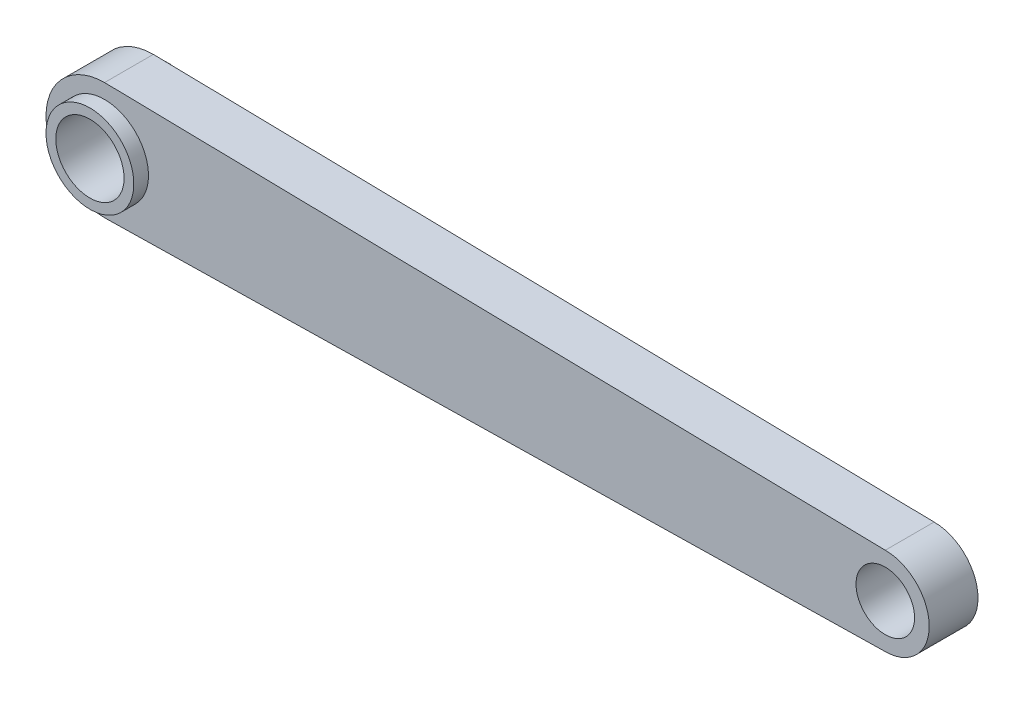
ISO-10303-21;
HEADER;
FILE_DESCRIPTION(('STEP AP214'),'2;1');
FILE_NAME('part.step','',(''),(''),'','','');
FILE_SCHEMA(('AUTOMOTIVE_DESIGN { 1 0 10303 214 1 1 1 1 }'));
ENDSEC;
DATA;
#1=APPLICATION_CONTEXT('core data for automotive mechanical design processes');
#2=APPLICATION_PROTOCOL_DEFINITION('international standard','automotive_design',2000,#1);
#3=PRODUCT_CONTEXT('',#1,'mechanical');
#4=PRODUCT('Part','Part','',(#3));
#5=PRODUCT_RELATED_PRODUCT_CATEGORY('part','',(#4));
#6=PRODUCT_DEFINITION_FORMATION('','',#4);
#7=PRODUCT_DEFINITION_CONTEXT('part definition',#1,'design');
#8=PRODUCT_DEFINITION('design','',#6,#7);
#9=PRODUCT_DEFINITION_SHAPE('','',#8);
#10=(LENGTH_UNIT() NAMED_UNIT(*) SI_UNIT(.MILLI.,.METRE.));
#11=(NAMED_UNIT(*) PLANE_ANGLE_UNIT() SI_UNIT($,.RADIAN.));
#12=(NAMED_UNIT(*) SI_UNIT($,.STERADIAN.) SOLID_ANGLE_UNIT());
#13=UNCERTAINTY_MEASURE_WITH_UNIT(LENGTH_MEASURE(1.E-05),#10,'distance_accuracy_value','');
#14=(GEOMETRIC_REPRESENTATION_CONTEXT(3) GLOBAL_UNCERTAINTY_ASSIGNED_CONTEXT((#13)) GLOBAL_UNIT_ASSIGNED_CONTEXT((#10,
#11,#12)) REPRESENTATION_CONTEXT('',''));
#15=CARTESIAN_POINT('',(0.,0.,0.));
#16=DIRECTION('',(0.,0.,1.));
#17=DIRECTION('',(1.,0.,0.));
#18=AXIS2_PLACEMENT_3D('',#15,#16,#17);
#19=CARTESIAN_POINT('',(0.,0.,6.35000000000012));
#20=DIRECTION('',(0.,0.,0.999999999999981));
#21=DIRECTION('',(1.,0.,0.));
#22=AXIS2_PLACEMENT_3D('',#19,#20,#21);
#23=PLANE('',#22);
#24=CARTESIAN_POINT('',(203.2,0.,6.34999999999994));
#25=DIRECTION('',(0.,0.,0.999999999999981));
#26=DIRECTION('',(1.,0.,0.));
#27=AXIS2_PLACEMENT_3D('',#24,#25,#26);
#28=CIRCLE('',#27,7.62000000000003);
#29=CARTESIAN_POINT('',(210.82,0.,6.34999999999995));
#30=VERTEX_POINT('',#29);
#31=EDGE_CURVE('E147',#30,#30,#28,.T.);
#32=ORIENTED_EDGE('',*,*,#31,.F.);
#33=EDGE_LOOP('',(#32));
#34=FACE_BOUND('',#33,.T.);
#35=CARTESIAN_POINT('',(0.,0.,6.35000000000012));
#36=DIRECTION('',(0.,0.,0.999999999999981));
#37=DIRECTION('',(1.,0.,0.));
#38=AXIS2_PLACEMENT_3D('',#35,#36,#37);
#39=CIRCLE('',#38,15.24);
#40=CARTESIAN_POINT('',(0.,15.2399999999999,6.35000000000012));
#41=VERTEX_POINT('',#40);
#42=CARTESIAN_POINT('',(1.00613961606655E-13,-15.2399999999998,6.34999999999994));
#43=VERTEX_POINT('',#42);
#44=EDGE_CURVE('E110',#41,#43,#39,.T.);
#45=ORIENTED_EDGE('',*,*,#44,.T.);
#46=DIRECTION('',(0.999824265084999,0.0187467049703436,0.));
#47=VECTOR('',#46,1.);
#48=CARTESIAN_POINT('',(1.00613961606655E-13,-15.2399999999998,6.34999999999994));
#49=LINE('',#48,#47);
#50=CARTESIAN_POINT('',(203.2,-11.4299999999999,6.34999999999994));
#51=VERTEX_POINT('',#50);
#52=EDGE_CURVE('E82',#43,#51,#49,.T.);
#53=ORIENTED_EDGE('',*,*,#52,.T.);
#54=CARTESIAN_POINT('',(203.2,0.,6.34999999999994));
#55=DIRECTION('',(0.,0.,0.999999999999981));
#56=DIRECTION('',(-1.,0.,0.));
#57=AXIS2_PLACEMENT_3D('',#54,#55,#56);
#58=CIRCLE('',#57,11.43);
#59=CARTESIAN_POINT('',(203.2,11.4300000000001,6.35000000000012));
#60=VERTEX_POINT('',#59);
#61=EDGE_CURVE('E57',#51,#60,#58,.T.);
#62=ORIENTED_EDGE('',*,*,#61,.T.);
#63=DIRECTION('',(-0.999824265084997,0.0187467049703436,0.));
#64=VECTOR('',#63,1.);
#65=CARTESIAN_POINT('',(0.,15.2399999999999,6.35000000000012));
#66=LINE('',#65,#64);
#67=EDGE_CURVE('E52',#60,#41,#66,.T.);
#68=ORIENTED_EDGE('',*,*,#67,.T.);
#69=EDGE_LOOP('',(#45,#53,#62,#68));
#70=FACE_BOUND('',#69,.T.);
#71=CARTESIAN_POINT('',(0.,0.,6.35000000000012));
#72=DIRECTION('',(0.,0.,0.999999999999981));
#73=DIRECTION('',(1.,0.,0.));
#74=AXIS2_PLACEMENT_3D('',#71,#72,#73);
#75=CIRCLE('',#74,11.43);
#76=CARTESIAN_POINT('',(-11.43,0.,6.35000000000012));
#77=VERTEX_POINT('',#76);
#78=EDGE_CURVE('E100',#77,#77,#75,.F.);
#79=ORIENTED_EDGE('',*,*,#78,.T.);
#80=EDGE_LOOP('',(#79));
#81=FACE_BOUND('',#80,.T.);
#82=ADVANCED_FACE('F36',(#34,#70,#81),#23,.T.);
#83=CARTESIAN_POINT('',(0.,0.,-6.34999999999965));
#84=DIRECTION('',(0.,0.,0.999999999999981));
#85=DIRECTION('',(1.,0.,0.));
#86=AXIS2_PLACEMENT_3D('',#83,#84,#85);
#87=PLANE('',#86);
#88=CARTESIAN_POINT('',(203.2,0.,-6.34999999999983));
#89=DIRECTION('',(0.,0.,0.999999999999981));
#90=DIRECTION('',(1.,0.,0.));
#91=AXIS2_PLACEMENT_3D('',#88,#89,#90);
#92=CIRCLE('',#91,7.62000000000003);
#93=CARTESIAN_POINT('',(210.82,0.,-6.34999999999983));
#94=VERTEX_POINT('',#93);
#95=EDGE_CURVE('E40',#94,#94,#92,.T.);
#96=ORIENTED_EDGE('',*,*,#95,.T.);
#97=EDGE_LOOP('',(#96));
#98=FACE_BOUND('',#97,.T.);
#99=CARTESIAN_POINT('',(0.,0.,-6.34999999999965));
#100=DIRECTION('',(0.,0.,0.999999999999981));
#101=DIRECTION('',(1.,0.,0.));
#102=AXIS2_PLACEMENT_3D('',#99,#100,#101);
#103=CIRCLE('',#102,15.24);
#104=CARTESIAN_POINT('',(0.,15.2399999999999,-6.34999999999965));
#105=VERTEX_POINT('',#104);
#106=CARTESIAN_POINT('',(0.,-15.2400000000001,-6.34999999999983));
#107=VERTEX_POINT('',#106);
#108=EDGE_CURVE('E94',#105,#107,#103,.T.);
#109=ORIENTED_EDGE('',*,*,#108,.F.);
#110=DIRECTION('',(-0.999824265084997,0.0187467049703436,0.));
#111=VECTOR('',#110,1.);
#112=CARTESIAN_POINT('',(0.,15.2399999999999,-6.34999999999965));
#113=LINE('',#112,#111);
#114=CARTESIAN_POINT('',(203.2,11.4300000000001,-6.34999999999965));
#115=VERTEX_POINT('',#114);
#116=EDGE_CURVE('E108',#115,#105,#113,.T.);
#117=ORIENTED_EDGE('',*,*,#116,.F.);
#118=CARTESIAN_POINT('',(203.2,0.,-6.34999999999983));
#119=DIRECTION('',(0.,0.,0.999999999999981));
#120=DIRECTION('',(-1.,0.,0.));
#121=AXIS2_PLACEMENT_3D('',#118,#119,#120);
#122=CIRCLE('',#121,11.43);
#123=CARTESIAN_POINT('',(203.2,-11.4299999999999,-6.34999999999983));
#124=VERTEX_POINT('',#123);
#125=EDGE_CURVE('E97',#124,#115,#122,.T.);
#126=ORIENTED_EDGE('',*,*,#125,.F.);
#127=DIRECTION('',(0.999824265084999,0.0187467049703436,0.));
#128=VECTOR('',#127,1.);
#129=CARTESIAN_POINT('',(0.,-15.2400000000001,-6.34999999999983));
#130=LINE('',#129,#128);
#131=EDGE_CURVE('E81',#107,#124,#130,.T.);
#132=ORIENTED_EDGE('',*,*,#131,.F.);
#133=EDGE_LOOP('',(#109,#117,#126,#132));
#134=FACE_BOUND('',#133,.T.);
#135=CARTESIAN_POINT('',(0.,0.,-6.34999999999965));
#136=DIRECTION('',(0.,0.,0.999999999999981));
#137=DIRECTION('',(1.,0.,0.));
#138=AXIS2_PLACEMENT_3D('',#135,#136,#137);
#139=CIRCLE('',#138,11.43);
#140=CARTESIAN_POINT('',(-11.43,0.,-6.34999999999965));
#141=VERTEX_POINT('',#140);
#142=EDGE_CURVE('E11',#141,#141,#139,.F.);
#143=ORIENTED_EDGE('',*,*,#142,.F.);
#144=EDGE_LOOP('',(#143));
#145=FACE_BOUND('',#144,.T.);
#146=ADVANCED_FACE('F91',(#98,#134,#145),#87,.F.);
#147=CARTESIAN_POINT('',(0.,0.,6.35000000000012));
#148=DIRECTION('',(0.,0.,-0.999999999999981));
#149=DIRECTION('',(-1.,0.,0.));
#150=AXIS2_PLACEMENT_3D('',#147,#148,#149);
#151=CYLINDRICAL_SURFACE('',#150,15.24);
#152=DIRECTION('',(0.,0.,-0.999999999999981));
#153=VECTOR('',#152,1.);
#154=CARTESIAN_POINT('',(0.,15.2399999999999,6.35000000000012));
#155=LINE('',#154,#153);
#156=EDGE_CURVE('E99',#41,#105,#155,.T.);
#157=ORIENTED_EDGE('',*,*,#156,.T.);
#158=ORIENTED_EDGE('',*,*,#108,.T.);
#159=DIRECTION('',(0.,0.,-0.999999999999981));
#160=VECTOR('',#159,1.);
#161=CARTESIAN_POINT('',(1.00613961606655E-13,-15.2399999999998,6.34999999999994));
#162=LINE('',#161,#160);
#163=EDGE_CURVE('E45',#43,#107,#162,.T.);
#164=ORIENTED_EDGE('',*,*,#163,.F.);
#165=ORIENTED_EDGE('',*,*,#44,.F.);
#166=EDGE_LOOP('',(#157,#158,#164,#165));
#167=FACE_BOUND('',#166,.T.);
#168=ADVANCED_FACE('F38',(#167),#151,.T.);
#169=CARTESIAN_POINT('',(1.00613961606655E-13,-15.2399999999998,6.34999999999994));
#170=DIRECTION('',(-0.0187467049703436,0.999824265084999,0.));
#171=DIRECTION('',(-0.999824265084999,-0.0187467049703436,0.));
#172=AXIS2_PLACEMENT_3D('',#169,#170,#171);
#173=PLANE('',#172);
#174=ORIENTED_EDGE('',*,*,#163,.T.);
#175=ORIENTED_EDGE('',*,*,#131,.T.);
#176=DIRECTION('',(0.,0.,-0.999999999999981));
#177=VECTOR('',#176,1.);
#178=CARTESIAN_POINT('',(203.2,-11.4299999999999,6.34999999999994));
#179=LINE('',#178,#177);
#180=EDGE_CURVE('E86',#51,#124,#179,.T.);
#181=ORIENTED_EDGE('',*,*,#180,.F.);
#182=ORIENTED_EDGE('',*,*,#52,.F.);
#183=EDGE_LOOP('',(#174,#175,#181,#182));
#184=FACE_BOUND('',#183,.T.);
#185=ADVANCED_FACE('F79',(#184),#173,.F.);
#186=CARTESIAN_POINT('',(203.2,0.,6.34999999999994));
#187=DIRECTION('',(0.,0.,-0.999999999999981));
#188=DIRECTION('',(-1.,0.,0.));
#189=AXIS2_PLACEMENT_3D('',#186,#187,#188);
#190=CYLINDRICAL_SURFACE('',#189,11.43);
#191=ORIENTED_EDGE('',*,*,#180,.T.);
#192=ORIENTED_EDGE('',*,*,#125,.T.);
#193=DIRECTION('',(0.,0.,-0.999999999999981));
#194=VECTOR('',#193,1.);
#195=CARTESIAN_POINT('',(203.2,11.4300000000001,6.35000000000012));
#196=LINE('',#195,#194);
#197=EDGE_CURVE('E116',#60,#115,#196,.T.);
#198=ORIENTED_EDGE('',*,*,#197,.F.);
#199=ORIENTED_EDGE('',*,*,#61,.F.);
#200=EDGE_LOOP('',(#191,#192,#198,#199));
#201=FACE_BOUND('',#200,.T.);
#202=ADVANCED_FACE('F119',(#201),#190,.T.);
#203=CARTESIAN_POINT('',(0.,15.2399999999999,6.35000000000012));
#204=DIRECTION('',(-0.0187467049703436,-0.999824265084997,0.));
#205=DIRECTION('',(0.999824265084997,-0.0187467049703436,0.));
#206=AXIS2_PLACEMENT_3D('',#203,#204,#205);
#207=PLANE('',#206);
#208=ORIENTED_EDGE('',*,*,#197,.T.);
#209=ORIENTED_EDGE('',*,*,#116,.T.);
#210=ORIENTED_EDGE('',*,*,#156,.F.);
#211=ORIENTED_EDGE('',*,*,#67,.F.);
#212=EDGE_LOOP('',(#208,#209,#210,#211));
#213=FACE_BOUND('',#212,.T.);
#214=ADVANCED_FACE('F121',(#213),#207,.F.);
#215=CARTESIAN_POINT('',(0.,0.,-10.1599999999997));
#216=DIRECTION('',(0.,0.,0.999999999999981));
#217=DIRECTION('',(1.,0.,0.));
#218=AXIS2_PLACEMENT_3D('',#215,#216,#217);
#219=PLANE('',#218);
#220=CARTESIAN_POINT('',(0.,0.,-10.1599999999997));
#221=DIRECTION('',(0.,0.,0.999999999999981));
#222=DIRECTION('',(1.,0.,0.));
#223=AXIS2_PLACEMENT_3D('',#220,#221,#222);
#224=CIRCLE('',#223,8.89);
#225=CARTESIAN_POINT('',(8.89000000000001,0.,-10.1599999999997));
#226=VERTEX_POINT('',#225);
#227=EDGE_CURVE('E139',#226,#226,#224,.T.);
#228=ORIENTED_EDGE('',*,*,#227,.T.);
#229=EDGE_LOOP('',(#228));
#230=FACE_BOUND('',#229,.T.);
#231=CARTESIAN_POINT('',(0.,0.,-10.1599999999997));
#232=DIRECTION('',(0.,0.,0.999999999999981));
#233=DIRECTION('',(1.,0.,0.));
#234=AXIS2_PLACEMENT_3D('',#231,#232,#233);
#235=CIRCLE('',#234,11.43);
#236=CARTESIAN_POINT('',(-11.43,0.,-10.1599999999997));
#237=VERTEX_POINT('',#236);
#238=EDGE_CURVE('E137',#237,#237,#235,.T.);
#239=ORIENTED_EDGE('',*,*,#238,.F.);
#240=EDGE_LOOP('',(#239));
#241=FACE_BOUND('',#240,.T.);
#242=ADVANCED_FACE('F165',(#230,#241),#219,.F.);
#243=CARTESIAN_POINT('',(0.,0.,10.1599999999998));
#244=DIRECTION('',(0.,0.,-0.999999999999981));
#245=DIRECTION('',(-1.,0.,0.));
#246=AXIS2_PLACEMENT_3D('',#243,#244,#245);
#247=CYLINDRICAL_SURFACE('',#246,11.43);
#248=CARTESIAN_POINT('',(-11.43,0.,-10.1599999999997));
#249=CARTESIAN_POINT('',(-11.43,0.,-10.1203124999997));
#250=CARTESIAN_POINT('',(-11.43,0.,-10.0806249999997));
#251=CARTESIAN_POINT('',(-11.43,0.,-10.0012499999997));
#252=CARTESIAN_POINT('',(-11.43,0.,-9.96156249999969));
#253=CARTESIAN_POINT('',(-11.43,0.,-9.88218749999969));
#254=CARTESIAN_POINT('',(-11.43,0.,-9.84249999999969));
#255=CARTESIAN_POINT('',(-11.43,0.,-9.76312499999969));
#256=CARTESIAN_POINT('',(-11.43,0.,-9.72343749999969));
#257=CARTESIAN_POINT('',(-11.43,0.,-9.64406249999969));
#258=CARTESIAN_POINT('',(-11.43,0.,-9.60437499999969));
#259=CARTESIAN_POINT('',(-11.43,0.,-9.52499999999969));
#260=CARTESIAN_POINT('',(-11.43,0.,-9.48531249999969));
#261=CARTESIAN_POINT('',(-11.43,0.,-9.40593749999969));
#262=CARTESIAN_POINT('',(-11.43,0.,-9.36624999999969));
#263=CARTESIAN_POINT('',(-11.43,0.,-9.28687499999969));
#264=CARTESIAN_POINT('',(-11.43,0.,-9.24718749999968));
#265=CARTESIAN_POINT('',(-11.43,0.,-9.16781249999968));
#266=CARTESIAN_POINT('',(-11.43,0.,-9.12812499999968));
#267=CARTESIAN_POINT('',(-11.43,0.,-9.04874999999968));
#268=CARTESIAN_POINT('',(-11.43,0.,-9.00906249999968));
#269=CARTESIAN_POINT('',(-11.43,0.,-8.92968749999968));
#270=CARTESIAN_POINT('',(-11.43,0.,-8.88999999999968));
#271=CARTESIAN_POINT('',(-11.43,0.,-8.81062499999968));
#272=CARTESIAN_POINT('',(-11.43,0.,-8.77093749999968));
#273=CARTESIAN_POINT('',(-11.43,0.,-8.69156249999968));
#274=CARTESIAN_POINT('',(-11.43,0.,-8.65187499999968));
#275=CARTESIAN_POINT('',(-11.43,0.,-8.57249999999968));
#276=CARTESIAN_POINT('',(-11.43,0.,-8.53281249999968));
#277=CARTESIAN_POINT('',(-11.43,0.,-8.45343749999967));
#278=CARTESIAN_POINT('',(-11.43,0.,-8.41374999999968));
#279=CARTESIAN_POINT('',(-11.43,0.,-8.33437499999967));
#280=CARTESIAN_POINT('',(-11.43,0.,-8.29468749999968));
#281=CARTESIAN_POINT('',(-11.43,0.,-8.21531249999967));
#282=CARTESIAN_POINT('',(-11.43,0.,-8.17562499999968));
#283=CARTESIAN_POINT('',(-11.43,0.,-8.09624999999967));
#284=CARTESIAN_POINT('',(-11.43,0.,-8.05656249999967));
#285=CARTESIAN_POINT('',(-11.43,0.,-7.97718749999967));
#286=CARTESIAN_POINT('',(-11.43,0.,-7.93749999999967));
#287=CARTESIAN_POINT('',(-11.43,0.,-7.85812499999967));
#288=CARTESIAN_POINT('',(-11.43,0.,-7.81843749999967));
#289=CARTESIAN_POINT('',(-11.43,0.,-7.73906249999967));
#290=CARTESIAN_POINT('',(-11.43,0.,-7.69937499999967));
#291=CARTESIAN_POINT('',(-11.43,0.,-7.61999999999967));
#292=CARTESIAN_POINT('',(-11.43,0.,-7.58031249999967));
#293=CARTESIAN_POINT('',(-11.43,0.,-7.50093749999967));
#294=CARTESIAN_POINT('',(-11.43,0.,-7.46124999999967));
#295=CARTESIAN_POINT('',(-11.43,0.,-7.38187499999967));
#296=CARTESIAN_POINT('',(-11.43,0.,-7.34218749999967));
#297=CARTESIAN_POINT('',(-11.43,0.,-7.26281249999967));
#298=CARTESIAN_POINT('',(-11.43,0.,-7.22312499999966));
#299=CARTESIAN_POINT('',(-11.43,0.,-7.14374999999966));
#300=CARTESIAN_POINT('',(-11.43,0.,-7.10406249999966));
#301=CARTESIAN_POINT('',(-11.43,0.,-7.02468749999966));
#302=CARTESIAN_POINT('',(-11.43,0.,-6.98499999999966));
#303=CARTESIAN_POINT('',(-11.43,0.,-6.90562499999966));
#304=CARTESIAN_POINT('',(-11.43,0.,-6.86593749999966));
#305=CARTESIAN_POINT('',(-11.43,0.,-6.78656249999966));
#306=CARTESIAN_POINT('',(-11.43,0.,-6.74687499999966));
#307=CARTESIAN_POINT('',(-11.43,0.,-6.66749999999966));
#308=CARTESIAN_POINT('',(-11.43,0.,-6.62781249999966));
#309=CARTESIAN_POINT('',(-11.43,0.,-6.54843749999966));
#310=CARTESIAN_POINT('',(-11.43,0.,-6.50874999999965));
#311=CARTESIAN_POINT('',(-11.43,0.,-6.42937499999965));
#312=CARTESIAN_POINT('',(-11.43,0.,-6.38968749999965));
#313=CARTESIAN_POINT('',(-11.43,0.,-6.34999999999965));
#314=B_SPLINE_CURVE_WITH_KNOTS('',3,(#248,#249,#250,#251,#252,#253,#254,#255,#256,#257,#258,
#259,#260,#261,#262,#263,#264,#265,#266,#267,#268,#269,#270,#271,#272,#273,#274,#275,#276,#277,
#278,#279,#280,#281,#282,#283,#284,#285,#286,#287,#288,#289,#290,#291,#292,#293,#294,#295,#296,
#297,#298,#299,#300,#301,#302,#303,#304,#305,#306,#307,#308,#309,#310,#311,#312,#313),
.UNSPECIFIED.,.F.,.F.,(4,2,2,2,2,2,2,2,2,2,2,2,2,2,2,2,2,2,2,2,2,2,2,2,2,2,2,2,2,2,2,2,4),(0.,
0.119062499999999,0.238125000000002,0.357187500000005,0.476250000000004,0.595312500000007,
0.714375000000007,0.833437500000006,0.952500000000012,1.07156250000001,1.19062500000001,
1.30968750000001,1.42875000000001,1.54781250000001,1.66687500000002,1.78593750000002,
1.90500000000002,2.02406250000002,2.14312500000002,2.26218750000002,2.38125000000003,
2.50031250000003,2.61937500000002,2.73843750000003,2.85750000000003,2.97656250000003,
3.09562500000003,3.21468750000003,3.33375000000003,3.45281250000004,3.57187500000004,
3.69093750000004,3.81000000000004),.UNSPECIFIED.);
#315=EDGE_CURVE('BSEAM132',#237,#141,#314,.T.);
#316=ORIENTED_EDGE('',*,*,#238,.T.);
#317=ORIENTED_EDGE('',*,*,#142,.T.);
#318=ORIENTED_EDGE('',*,*,#315,.T.);
#319=ORIENTED_EDGE('',*,*,#315,.F.);
#320=EDGE_LOOP('',(#316,#318,#317,#319));
#321=FACE_BOUND('',#320,.T.);
#322=ADVANCED_FACE('F132',(#321),#247,.T.);
#323=CARTESIAN_POINT('',(0.,0.,10.1599999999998));
#324=DIRECTION('',(0.,0.,0.999999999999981));
#325=DIRECTION('',(1.,0.,0.));
#326=AXIS2_PLACEMENT_3D('',#323,#324,#325);
#327=CIRCLE('',#326,11.43);
#328=CARTESIAN_POINT('',(-11.43,0.,10.1599999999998));
#329=VERTEX_POINT('',#328);
#330=EDGE_CURVE('E103',#329,#329,#327,.T.);
#331=CARTESIAN_POINT('',(-11.43,0.,6.35000000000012));
#332=CARTESIAN_POINT('',(-11.43,0.,6.38968750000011));
#333=CARTESIAN_POINT('',(-11.43,0.,6.42937500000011));
#334=CARTESIAN_POINT('',(-11.43,0.,6.5087500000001));
#335=CARTESIAN_POINT('',(-11.43,0.,6.5484375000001));
#336=CARTESIAN_POINT('',(-11.43,0.,6.62781250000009));
#337=CARTESIAN_POINT('',(-11.43,0.,6.66750000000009));
#338=CARTESIAN_POINT('',(-11.43,0.,6.74687500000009));
#339=CARTESIAN_POINT('',(-11.43,0.,6.78656250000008));
#340=CARTESIAN_POINT('',(-11.43,0.,6.86593750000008));
#341=CARTESIAN_POINT('',(-11.43,0.,6.90562500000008));
#342=CARTESIAN_POINT('',(-11.43,0.,6.98500000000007));
#343=CARTESIAN_POINT('',(-11.43,0.,7.02468750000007));
#344=CARTESIAN_POINT('',(-11.43,0.,7.10406250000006));
#345=CARTESIAN_POINT('',(-11.43,0.,7.14375000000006));
#346=CARTESIAN_POINT('',(-11.43,0.,7.22312500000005));
#347=CARTESIAN_POINT('',(-11.43,0.,7.26281250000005));
#348=CARTESIAN_POINT('',(-11.43,0.,7.34218750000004));
#349=CARTESIAN_POINT('',(-11.43,0.,7.38187500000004));
#350=CARTESIAN_POINT('',(-11.43,0.,7.46125000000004));
#351=CARTESIAN_POINT('',(-11.43,0.,7.50093750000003));
#352=CARTESIAN_POINT('',(-11.43,0.,7.58031250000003));
#353=CARTESIAN_POINT('',(-11.43,0.,7.62000000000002));
#354=CARTESIAN_POINT('',(-11.43,0.,7.69937500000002));
#355=CARTESIAN_POINT('',(-11.43,0.,7.73906250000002));
#356=CARTESIAN_POINT('',(-11.43,0.,7.81843750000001));
#357=CARTESIAN_POINT('',(-11.43,0.,7.85812500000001));
#358=CARTESIAN_POINT('',(-11.43,0.,7.9375));
#359=CARTESIAN_POINT('',(-11.43,0.,7.9771875));
#360=CARTESIAN_POINT('',(-11.43,0.,8.05656249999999));
#361=CARTESIAN_POINT('',(-11.43,0.,8.09624999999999));
#362=CARTESIAN_POINT('',(-11.43,0.,8.17562499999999));
#363=CARTESIAN_POINT('',(-11.43,0.,8.21531249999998));
#364=CARTESIAN_POINT('',(-11.43,0.,8.29468749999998));
#365=CARTESIAN_POINT('',(-11.43,0.,8.33437499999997));
#366=CARTESIAN_POINT('',(-11.43,0.,8.41374999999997));
#367=CARTESIAN_POINT('',(-11.43,0.,8.45343749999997));
#368=CARTESIAN_POINT('',(-11.43,0.,8.53281249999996));
#369=CARTESIAN_POINT('',(-11.43,0.,8.57249999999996));
#370=CARTESIAN_POINT('',(-11.43,0.,8.65187499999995));
#371=CARTESIAN_POINT('',(-11.43,0.,8.69156249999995));
#372=CARTESIAN_POINT('',(-11.43,0.,8.77093749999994));
#373=CARTESIAN_POINT('',(-11.43,0.,8.81062499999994));
#374=CARTESIAN_POINT('',(-11.43,0.,8.88999999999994));
#375=CARTESIAN_POINT('',(-11.43,0.,8.92968749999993));
#376=CARTESIAN_POINT('',(-11.43,0.,9.00906249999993));
#377=CARTESIAN_POINT('',(-11.43,0.,9.04874999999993));
#378=CARTESIAN_POINT('',(-11.43,0.,9.12812499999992));
#379=CARTESIAN_POINT('',(-11.43,0.,9.16781249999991));
#380=CARTESIAN_POINT('',(-11.43,0.,9.24718749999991));
#381=CARTESIAN_POINT('',(-11.43,0.,9.28687499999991));
#382=CARTESIAN_POINT('',(-11.43,0.,9.3662499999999));
#383=CARTESIAN_POINT('',(-11.43,0.,9.4059374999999));
#384=CARTESIAN_POINT('',(-11.43,0.,9.48531249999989));
#385=CARTESIAN_POINT('',(-11.43,0.,9.52499999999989));
#386=CARTESIAN_POINT('',(-11.43,0.,9.60437499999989));
#387=CARTESIAN_POINT('',(-11.43,0.,9.64406249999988));
#388=CARTESIAN_POINT('',(-11.43,0.,9.72343749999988));
#389=CARTESIAN_POINT('',(-11.43,0.,9.76312499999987));
#390=CARTESIAN_POINT('',(-11.43,0.,9.84249999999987));
#391=CARTESIAN_POINT('',(-11.43,0.,9.88218749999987));
#392=CARTESIAN_POINT('',(-11.43,0.,9.96156249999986));
#393=CARTESIAN_POINT('',(-11.43,0.,10.0012499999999));
#394=CARTESIAN_POINT('',(-11.43,0.,10.0806249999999));
#395=CARTESIAN_POINT('',(-11.43,0.,10.1203124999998));
#396=CARTESIAN_POINT('',(-11.43,0.,10.1599999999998));
#397=B_SPLINE_CURVE_WITH_KNOTS('',3,(#331,#332,#333,#334,#335,#336,#337,#338,#339,#340,#341,
#342,#343,#344,#345,#346,#347,#348,#349,#350,#351,#352,#353,#354,#355,#356,#357,#358,#359,#360,
#361,#362,#363,#364,#365,#366,#367,#368,#369,#370,#371,#372,#373,#374,#375,#376,#377,#378,#379,
#380,#381,#382,#383,#384,#385,#386,#387,#388,#389,#390,#391,#392,#393,#394,#395,#396),
.UNSPECIFIED.,.F.,.F.,(4,2,2,2,2,2,2,2,2,2,2,2,2,2,2,2,2,2,2,2,2,2,2,2,2,2,2,2,2,2,2,2,4),(0.,
0.119062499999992,0.238124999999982,0.357187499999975,0.476249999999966,0.595312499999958,
0.714374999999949,0.833437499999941,0.952499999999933,1.07156249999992,1.19062499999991,
1.30968749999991,1.4287499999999,1.54781249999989,1.66687499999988,1.78593749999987,
1.90499999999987,2.02406249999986,2.14312499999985,2.26218749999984,2.38124999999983,
2.50031249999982,2.61937499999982,2.73843749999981,2.8574999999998,2.97656249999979,
3.09562499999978,3.21468749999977,3.33374999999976,3.45281249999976,3.57187499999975,
3.69093749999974,3.80999999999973),.UNSPECIFIED.);
#398=EDGE_CURVE('BSEAM128',#77,#329,#397,.T.);
#399=ORIENTED_EDGE('',*,*,#78,.F.);
#400=ORIENTED_EDGE('',*,*,#330,.F.);
#401=ORIENTED_EDGE('',*,*,#398,.T.);
#402=ORIENTED_EDGE('',*,*,#398,.F.);
#403=EDGE_LOOP('',(#399,#401,#400,#402));
#404=FACE_BOUND('',#403,.T.);
#405=ADVANCED_FACE('F128',(#404),#247,.T.);
#406=CARTESIAN_POINT('',(0.,0.,10.1599999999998));
#407=DIRECTION('',(0.,0.,0.999999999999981));
#408=DIRECTION('',(1.,0.,0.));
#409=AXIS2_PLACEMENT_3D('',#406,#407,#408);
#410=PLANE('',#409);
#411=CARTESIAN_POINT('',(0.,0.,10.1599999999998));
#412=DIRECTION('',(0.,0.,0.999999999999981));
#413=DIRECTION('',(1.,0.,0.));
#414=AXIS2_PLACEMENT_3D('',#411,#412,#413);
#415=CIRCLE('',#414,8.89);
#416=CARTESIAN_POINT('',(8.89000000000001,0.,10.1599999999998));
#417=VERTEX_POINT('',#416);
#418=EDGE_CURVE('E144',#417,#417,#415,.T.);
#419=ORIENTED_EDGE('',*,*,#418,.F.);
#420=EDGE_LOOP('',(#419));
#421=FACE_BOUND('',#420,.T.);
#422=ORIENTED_EDGE('',*,*,#330,.T.);
#423=EDGE_LOOP('',(#422));
#424=FACE_BOUND('',#423,.T.);
#425=ADVANCED_FACE('F131',(#421,#424),#410,.T.);
#426=CARTESIAN_POINT('',(0.,0.,-10.1599999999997));
#427=DIRECTION('',(0.,0.,0.999999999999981));
#428=DIRECTION('',(1.,0.,0.));
#429=AXIS2_PLACEMENT_3D('',#426,#427,#428);
#430=CYLINDRICAL_SURFACE('',#429,8.89);
#431=CARTESIAN_POINT('',(8.89000000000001,0.,-10.1599999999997));
#432=CARTESIAN_POINT('',(8.89000000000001,0.,-9.94833333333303));
#433=CARTESIAN_POINT('',(8.89000000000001,0.,-9.73666666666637));
#434=CARTESIAN_POINT('',(8.89000000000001,0.,-9.31333333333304));
#435=CARTESIAN_POINT('',(8.89000000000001,0.,-9.10166666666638));
#436=CARTESIAN_POINT('',(8.89000000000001,0.,-8.67833333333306));
#437=CARTESIAN_POINT('',(8.89000000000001,0.,-8.4666666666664));
#438=CARTESIAN_POINT('',(8.89000000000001,0.,-8.04333333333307));
#439=CARTESIAN_POINT('',(8.89000000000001,0.,-7.83166666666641));
#440=CARTESIAN_POINT('',(8.89000000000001,0.,-7.40833333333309));
#441=CARTESIAN_POINT('',(8.89000000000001,0.,-7.19666666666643));
#442=CARTESIAN_POINT('',(8.89000000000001,0.,-6.7733333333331));
#443=CARTESIAN_POINT('',(8.89000000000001,0.,-6.56166666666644));
#444=CARTESIAN_POINT('',(8.89000000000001,0.,-6.13833333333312));
#445=CARTESIAN_POINT('',(8.89000000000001,0.,-5.92666666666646));
#446=CARTESIAN_POINT('',(8.89000000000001,0.,-5.50333333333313));
#447=CARTESIAN_POINT('',(8.89000000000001,0.,-5.29166666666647));
#448=CARTESIAN_POINT('',(8.89000000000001,0.,-4.86833333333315));
#449=CARTESIAN_POINT('',(8.89000000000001,0.,-4.65666666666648));
#450=CARTESIAN_POINT('',(8.89000000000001,0.,-4.23333333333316));
#451=CARTESIAN_POINT('',(8.89000000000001,0.,-4.0216666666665));
#452=CARTESIAN_POINT('',(8.89000000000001,0.,-3.59833333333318));
#453=CARTESIAN_POINT('',(8.89000000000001,0.,-3.38666666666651));
#454=CARTESIAN_POINT('',(8.89000000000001,0.,-2.96333333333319));
#455=CARTESIAN_POINT('',(8.89000000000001,0.,-2.75166666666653));
#456=CARTESIAN_POINT('',(8.89000000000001,0.,-2.3283333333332));
#457=CARTESIAN_POINT('',(8.89000000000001,0.,-2.11666666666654));
#458=CARTESIAN_POINT('',(8.89000000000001,0.,-1.69333333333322));
#459=CARTESIAN_POINT('',(8.89000000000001,0.,-1.48166666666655));
#460=CARTESIAN_POINT('',(8.89000000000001,0.,-1.05833333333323));
#461=CARTESIAN_POINT('',(8.89000000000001,0.,-0.84666666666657));
#462=CARTESIAN_POINT('',(8.89000000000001,0.,-0.423333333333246));
#463=CARTESIAN_POINT('',(8.89000000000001,0.,-0.211666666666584));
#464=CARTESIAN_POINT('',(8.89000000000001,0.,0.21166666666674));
#465=CARTESIAN_POINT('',(8.89000000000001,0.,0.423333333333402));
#466=CARTESIAN_POINT('',(8.89000000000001,0.,0.846666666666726));
#467=CARTESIAN_POINT('',(8.89000000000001,0.,1.05833333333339));
#468=CARTESIAN_POINT('',(8.89000000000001,0.,1.48166666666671));
#469=CARTESIAN_POINT('',(8.89000000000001,0.,1.69333333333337));
#470=CARTESIAN_POINT('',(8.89000000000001,0.,2.1166666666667));
#471=CARTESIAN_POINT('',(8.89000000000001,0.,2.32833333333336));
#472=CARTESIAN_POINT('',(8.89000000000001,0.,2.75166666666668));
#473=CARTESIAN_POINT('',(8.89000000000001,0.,2.96333333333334));
#474=CARTESIAN_POINT('',(8.89000000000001,0.,3.38666666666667));
#475=CARTESIAN_POINT('',(8.89000000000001,0.,3.59833333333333));
#476=CARTESIAN_POINT('',(8.89000000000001,0.,4.02166666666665));
#477=CARTESIAN_POINT('',(8.89000000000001,0.,4.23333333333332));
#478=CARTESIAN_POINT('',(8.89000000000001,0.,4.65666666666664));
#479=CARTESIAN_POINT('',(8.89000000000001,0.,4.8683333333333));
#480=CARTESIAN_POINT('',(8.89000000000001,0.,5.29166666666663));
#481=CARTESIAN_POINT('',(8.89000000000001,0.,5.50333333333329));
#482=CARTESIAN_POINT('',(8.89000000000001,0.,5.92666666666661));
#483=CARTESIAN_POINT('',(8.89000000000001,0.,6.13833333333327));
#484=CARTESIAN_POINT('',(8.89000000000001,0.,6.56166666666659));
#485=CARTESIAN_POINT('',(8.89000000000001,0.,6.77333333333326));
#486=CARTESIAN_POINT('',(8.89000000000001,0.,7.19666666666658));
#487=CARTESIAN_POINT('',(8.89000000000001,0.,7.40833333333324));
#488=CARTESIAN_POINT('',(8.89000000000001,0.,7.83166666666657));
#489=CARTESIAN_POINT('',(8.89000000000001,0.,8.04333333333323));
#490=CARTESIAN_POINT('',(8.89000000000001,0.,8.46666666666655));
#491=CARTESIAN_POINT('',(8.89000000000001,0.,8.67833333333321));
#492=CARTESIAN_POINT('',(8.89000000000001,0.,9.10166666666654));
#493=CARTESIAN_POINT('',(8.89000000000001,0.,9.3133333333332));
#494=CARTESIAN_POINT('',(8.89000000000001,0.,9.73666666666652));
#495=CARTESIAN_POINT('',(8.89000000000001,0.,9.94833333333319));
#496=CARTESIAN_POINT('',(8.89000000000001,0.,10.1599999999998));
#497=B_SPLINE_CURVE_WITH_KNOTS('',3,(#431,#432,#433,#434,#435,#436,#437,#438,#439,#440,#441,
#442,#443,#444,#445,#446,#447,#448,#449,#450,#451,#452,#453,#454,#455,#456,#457,#458,#459,#460,
#461,#462,#463,#464,#465,#466,#467,#468,#469,#470,#471,#472,#473,#474,#475,#476,#477,#478,#479,
#480,#481,#482,#483,#484,#485,#486,#487,#488,#489,#490,#491,#492,#493,#494,#495,#496),
.UNSPECIFIED.,.F.,.F.,(4,2,2,2,2,2,2,2,2,2,2,2,2,2,2,2,2,2,2,2,2,2,2,2,2,2,2,2,2,2,2,2,4),(0.,
0.634999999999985,1.26999999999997,1.90499999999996,2.53999999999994,3.17499999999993,
3.80999999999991,4.4449999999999,5.07999999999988,5.71499999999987,6.34999999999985,
6.98499999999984,7.61999999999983,8.25499999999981,8.8899999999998,9.52499999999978,
10.1599999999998,10.7949999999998,11.4299999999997,12.0649999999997,12.6999999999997,
13.3349999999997,13.9699999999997,14.6049999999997,15.2399999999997,15.8749999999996,
16.5099999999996,17.1449999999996,17.7799999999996,18.4149999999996,19.0499999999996,
19.6849999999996,20.3199999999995),.UNSPECIFIED.);
#498=EDGE_CURVE('BSEAM157',#226,#417,#497,.T.);
#499=ORIENTED_EDGE('',*,*,#227,.F.);
#500=ORIENTED_EDGE('',*,*,#418,.T.);
#501=ORIENTED_EDGE('',*,*,#498,.T.);
#502=ORIENTED_EDGE('',*,*,#498,.F.);
#503=EDGE_LOOP('',(#499,#501,#500,#502));
#504=FACE_BOUND('',#503,.T.);
#505=ADVANCED_FACE('F157',(#504),#430,.F.);
#506=CARTESIAN_POINT('',(203.2,0.,-10.1599999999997));
#507=DIRECTION('',(0.,0.,0.999999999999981));
#508=DIRECTION('',(1.,0.,0.));
#509=AXIS2_PLACEMENT_3D('',#506,#507,#508);
#510=CYLINDRICAL_SURFACE('',#509,7.62000000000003);
#511=CARTESIAN_POINT('',(210.82,0.,6.34999999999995));
#512=CARTESIAN_POINT('',(210.82,0.,6.21770833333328));
#513=CARTESIAN_POINT('',(210.82,0.,6.08541666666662));
#514=CARTESIAN_POINT('',(210.82,0.,5.82083333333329));
#515=CARTESIAN_POINT('',(210.82,0.,5.68854166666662));
#516=CARTESIAN_POINT('',(210.82,0.,5.42395833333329));
#517=CARTESIAN_POINT('',(210.82,0.,5.29166666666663));
#518=CARTESIAN_POINT('',(210.82,0.,5.0270833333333));
#519=CARTESIAN_POINT('',(210.82,0.,4.89479166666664));
#520=CARTESIAN_POINT('',(210.82,0.,4.63020833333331));
#521=CARTESIAN_POINT('',(210.82,0.,4.49791666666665));
#522=CARTESIAN_POINT('',(210.82,0.,4.23333333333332));
#523=CARTESIAN_POINT('',(210.82,0.,4.10104166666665));
#524=CARTESIAN_POINT('',(210.82,0.,3.83645833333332));
#525=CARTESIAN_POINT('',(210.82,0.,3.70416666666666));
#526=CARTESIAN_POINT('',(210.82,0.,3.43958333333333));
#527=CARTESIAN_POINT('',(210.82,0.,3.30729166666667));
#528=CARTESIAN_POINT('',(210.82,0.,3.04270833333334));
#529=CARTESIAN_POINT('',(210.82,0.,2.91041666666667));
#530=CARTESIAN_POINT('',(210.82,0.,2.64583333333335));
#531=CARTESIAN_POINT('',(210.82,0.,2.51354166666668));
#532=CARTESIAN_POINT('',(210.82,0.,2.24895833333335));
#533=CARTESIAN_POINT('',(210.82,0.,2.11666666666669));
#534=CARTESIAN_POINT('',(210.82,0.,1.85208333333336));
#535=CARTESIAN_POINT('',(210.82,0.,1.7197916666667));
#536=CARTESIAN_POINT('',(210.82,0.,1.45520833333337));
#537=CARTESIAN_POINT('',(210.82,0.,1.3229166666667));
#538=CARTESIAN_POINT('',(210.82,0.,1.05833333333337));
#539=CARTESIAN_POINT('',(210.82,0.,0.926041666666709));
#540=CARTESIAN_POINT('',(210.82,0.,0.661458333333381));
#541=CARTESIAN_POINT('',(210.82,0.,0.529166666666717));
#542=CARTESIAN_POINT('',(210.82,0.,0.264583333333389));
#543=CARTESIAN_POINT('',(210.82,0.,0.132291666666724));
#544=CARTESIAN_POINT('',(210.82,0.,-0.132291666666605));
#545=CARTESIAN_POINT('',(210.82,0.,-0.26458333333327));
#546=CARTESIAN_POINT('',(210.82,0.,-0.529166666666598));
#547=CARTESIAN_POINT('',(210.82,0.,-0.661458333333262));
#548=CARTESIAN_POINT('',(210.82,0.,-0.926041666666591));
#549=CARTESIAN_POINT('',(210.82,0.,-1.05833333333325));
#550=CARTESIAN_POINT('',(210.82,0.,-1.32291666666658));
#551=CARTESIAN_POINT('',(210.82,0.,-1.45520833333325));
#552=CARTESIAN_POINT('',(210.82,0.,-1.71979166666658));
#553=CARTESIAN_POINT('',(210.82,0.,-1.85208333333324));
#554=CARTESIAN_POINT('',(210.82,0.,-2.11666666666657));
#555=CARTESIAN_POINT('',(210.82,0.,-2.24895833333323));
#556=CARTESIAN_POINT('',(210.82,0.,-2.51354166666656));
#557=CARTESIAN_POINT('',(210.82,0.,-2.64583333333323));
#558=CARTESIAN_POINT('',(210.82,0.,-2.91041666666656));
#559=CARTESIAN_POINT('',(210.82,0.,-3.04270833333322));
#560=CARTESIAN_POINT('',(210.82,0.,-3.30729166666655));
#561=CARTESIAN_POINT('',(210.82,0.,-3.43958333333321));
#562=CARTESIAN_POINT('',(210.82,0.,-3.70416666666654));
#563=CARTESIAN_POINT('',(210.82,0.,-3.83645833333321));
#564=CARTESIAN_POINT('',(210.82,0.,-4.10104166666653));
#565=CARTESIAN_POINT('',(210.82,0.,-4.2333333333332));
#566=CARTESIAN_POINT('',(210.82,0.,-4.49791666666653));
#567=CARTESIAN_POINT('',(210.82,0.,-4.63020833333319));
#568=CARTESIAN_POINT('',(210.82,0.,-4.89479166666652));
#569=CARTESIAN_POINT('',(210.82,0.,-5.02708333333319));
#570=CARTESIAN_POINT('',(210.82,0.,-5.29166666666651));
#571=CARTESIAN_POINT('',(210.82,0.,-5.42395833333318));
#572=CARTESIAN_POINT('',(210.82,0.,-5.68854166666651));
#573=CARTESIAN_POINT('',(210.82,0.,-5.82083333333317));
#574=CARTESIAN_POINT('',(210.82,0.,-6.0854166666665));
#575=CARTESIAN_POINT('',(210.82,0.,-6.21770833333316));
#576=CARTESIAN_POINT('',(210.82,0.,-6.34999999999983));
#577=B_SPLINE_CURVE_WITH_KNOTS('',3,(#511,#512,#513,#514,#515,#516,#517,#518,#519,#520,#521,
#522,#523,#524,#525,#526,#527,#528,#529,#530,#531,#532,#533,#534,#535,#536,#537,#538,#539,#540,
#541,#542,#543,#544,#545,#546,#547,#548,#549,#550,#551,#552,#553,#554,#555,#556,#557,#558,#559,
#560,#561,#562,#563,#564,#565,#566,#567,#568,#569,#570,#571,#572,#573,#574,#575,#576),
.UNSPECIFIED.,.F.,.F.,(4,2,2,2,2,2,2,2,2,2,2,2,2,2,2,2,2,2,2,2,2,2,2,2,2,2,2,2,2,2,2,2,4),(0.,
0.396874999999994,0.793749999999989,1.19062499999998,1.58749999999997,1.98437499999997,
2.38124999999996,2.77812499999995,3.17499999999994,3.57187499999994,3.96874999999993,
4.36562499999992,4.76249999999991,5.15937499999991,5.5562499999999,5.95312499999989,
6.34999999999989,6.74687499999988,7.14374999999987,7.54062499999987,7.93749999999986,
8.33437499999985,8.73124999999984,9.12812499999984,9.52499999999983,9.92187499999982,
10.3187499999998,10.7156249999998,11.1124999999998,11.5093749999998,11.9062499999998,
12.3031249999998,12.6999999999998),.UNSPECIFIED.);
#578=EDGE_CURVE('BSEAM155',#30,#94,#577,.T.);
#579=ORIENTED_EDGE('',*,*,#31,.T.);
#580=ORIENTED_EDGE('',*,*,#95,.F.);
#581=ORIENTED_EDGE('',*,*,#578,.T.);
#582=ORIENTED_EDGE('',*,*,#578,.F.);
#583=EDGE_LOOP('',(#579,#581,#580,#582));
#584=FACE_BOUND('',#583,.T.);
#585=ADVANCED_FACE('F155',(#584),#510,.F.);
#586=CLOSED_SHELL('',(#82,#146,#168,#185,#202,#214,#242,#322,#405,#425,#505,#585));
#587=MANIFOLD_SOLID_BREP('B2',#586);
#588=ADVANCED_BREP_SHAPE_REPRESENTATION('',(#18,#587),#14);
#589=SHAPE_DEFINITION_REPRESENTATION(#9,#588);
ENDSEC;
END-ISO-10303-21;
